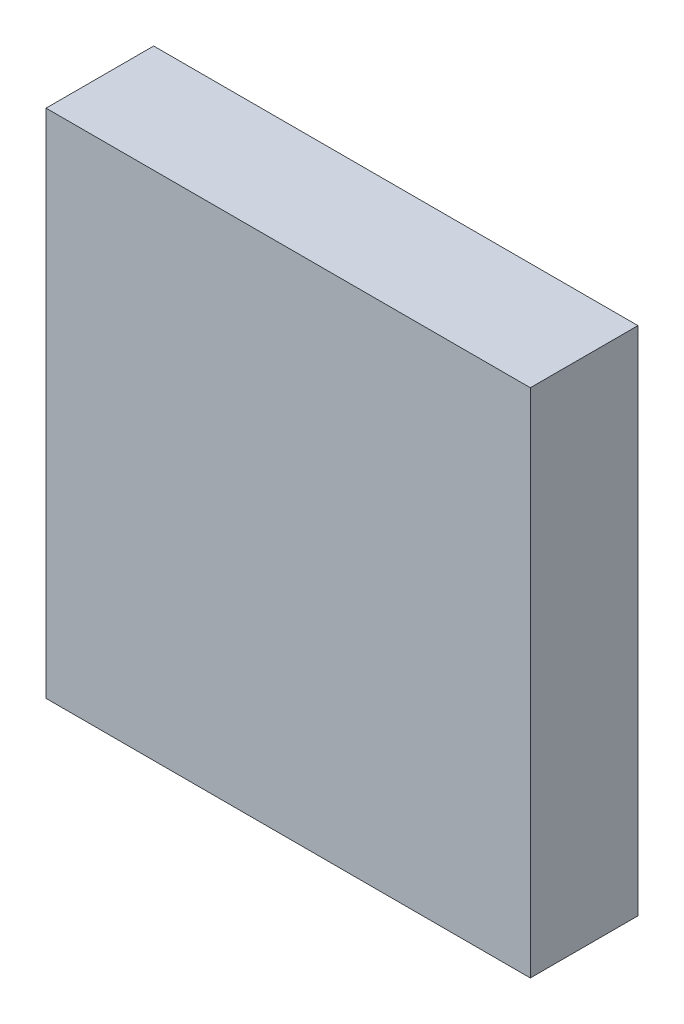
ISO-10303-21;
HEADER;
FILE_DESCRIPTION(('STEP AP214'),'2;1');
FILE_NAME('part.step','',(''),(''),'','','');
FILE_SCHEMA(('AUTOMOTIVE_DESIGN { 1 0 10303 214 1 1 1 1 }'));
ENDSEC;
DATA;
#1=APPLICATION_CONTEXT('core data for automotive mechanical design processes');
#2=APPLICATION_PROTOCOL_DEFINITION('international standard','automotive_design',2000,#1);
#3=PRODUCT_CONTEXT('',#1,'mechanical');
#4=PRODUCT('Part','Part','',(#3));
#5=PRODUCT_RELATED_PRODUCT_CATEGORY('part','',(#4));
#6=PRODUCT_DEFINITION_FORMATION('','',#4);
#7=PRODUCT_DEFINITION_CONTEXT('part definition',#1,'design');
#8=PRODUCT_DEFINITION('design','',#6,#7);
#9=PRODUCT_DEFINITION_SHAPE('','',#8);
#10=(LENGTH_UNIT() NAMED_UNIT(*) SI_UNIT(.MILLI.,.METRE.));
#11=(NAMED_UNIT(*) PLANE_ANGLE_UNIT() SI_UNIT($,.RADIAN.));
#12=(NAMED_UNIT(*) SI_UNIT($,.STERADIAN.) SOLID_ANGLE_UNIT());
#13=UNCERTAINTY_MEASURE_WITH_UNIT(LENGTH_MEASURE(1.E-05),#10,'distance_accuracy_value','');
#14=(GEOMETRIC_REPRESENTATION_CONTEXT(3) GLOBAL_UNCERTAINTY_ASSIGNED_CONTEXT((#13)) GLOBAL_UNIT_ASSIGNED_CONTEXT((#10,
#11,#12)) REPRESENTATION_CONTEXT('',''));
#15=CARTESIAN_POINT('',(0.,0.,0.));
#16=DIRECTION('',(0.,0.,1.));
#17=DIRECTION('',(1.,0.,0.));
#18=AXIS2_PLACEMENT_3D('',#15,#16,#17);
#19=CARTESIAN_POINT('',(0.,0.,20.));
#20=DIRECTION('',(1.,0.,0.));
#21=DIRECTION('',(0.,0.,-1.));
#22=AXIS2_PLACEMENT_3D('',#19,#20,#21);
#23=PLANE('',#22);
#24=DIRECTION('',(0.,-1.,0.));
#25=VECTOR('',#24,1.);
#26=CARTESIAN_POINT('',(0.,0.,0.));
#27=LINE('',#26,#25);
#28=CARTESIAN_POINT('',(0.,95.,0.));
#29=VERTEX_POINT('',#28);
#30=CARTESIAN_POINT('',(0.,0.,0.));
#31=VERTEX_POINT('',#30);
#32=EDGE_CURVE('E93',#29,#31,#27,.T.);
#33=ORIENTED_EDGE('',*,*,#32,.T.);
#34=DIRECTION('',(0.,0.,-1.));
#35=VECTOR('',#34,1.);
#36=CARTESIAN_POINT('',(0.,0.,20.));
#37=LINE('',#36,#35);
#38=CARTESIAN_POINT('',(0.,0.,20.));
#39=VERTEX_POINT('',#38);
#40=EDGE_CURVE('E11',#39,#31,#37,.T.);
#41=ORIENTED_EDGE('',*,*,#40,.F.);
#42=DIRECTION('',(0.,-1.,0.));
#43=VECTOR('',#42,1.);
#44=CARTESIAN_POINT('',(0.,0.,20.));
#45=LINE('',#44,#43);
#46=CARTESIAN_POINT('',(0.,95.,20.));
#47=VERTEX_POINT('',#46);
#48=EDGE_CURVE('E81',#47,#39,#45,.T.);
#49=ORIENTED_EDGE('',*,*,#48,.F.);
#50=DIRECTION('',(0.,0.,-1.));
#51=VECTOR('',#50,1.);
#52=CARTESIAN_POINT('',(0.,95.,20.));
#53=LINE('',#52,#51);
#54=EDGE_CURVE('E89',#47,#29,#53,.T.);
#55=ORIENTED_EDGE('',*,*,#54,.T.);
#56=EDGE_LOOP('',(#33,#41,#49,#55));
#57=FACE_BOUND('',#56,.T.);
#58=ADVANCED_FACE('F30',(#57),#23,.F.);
#59=CARTESIAN_POINT('',(0.,0.,20.));
#60=DIRECTION('',(0.,1.,0.));
#61=DIRECTION('',(0.,0.,1.));
#62=AXIS2_PLACEMENT_3D('',#59,#60,#61);
#63=PLANE('',#62);
#64=DIRECTION('',(1.,0.,0.));
#65=VECTOR('',#64,1.);
#66=CARTESIAN_POINT('',(0.,0.,0.));
#67=LINE('',#66,#65);
#68=CARTESIAN_POINT('',(90.,0.,0.));
#69=VERTEX_POINT('',#68);
#70=EDGE_CURVE('E85',#31,#69,#67,.T.);
#71=ORIENTED_EDGE('',*,*,#70,.T.);
#72=DIRECTION('',(0.,0.,-1.));
#73=VECTOR('',#72,1.);
#74=CARTESIAN_POINT('',(90.,0.,20.));
#75=LINE('',#74,#73);
#76=CARTESIAN_POINT('',(90.,0.,20.));
#77=VERTEX_POINT('',#76);
#78=EDGE_CURVE('E38',#77,#69,#75,.T.);
#79=ORIENTED_EDGE('',*,*,#78,.F.);
#80=DIRECTION('',(1.,0.,0.));
#81=VECTOR('',#80,1.);
#82=CARTESIAN_POINT('',(0.,0.,20.));
#83=LINE('',#82,#81);
#84=EDGE_CURVE('E76',#39,#77,#83,.T.);
#85=ORIENTED_EDGE('',*,*,#84,.F.);
#86=ORIENTED_EDGE('',*,*,#40,.T.);
#87=EDGE_LOOP('',(#71,#79,#85,#86));
#88=FACE_BOUND('',#87,.T.);
#89=ADVANCED_FACE('F84',(#88),#63,.F.);
#90=CARTESIAN_POINT('',(90.,0.,20.));
#91=DIRECTION('',(-1.,0.,0.));
#92=DIRECTION('',(0.,0.,1.));
#93=AXIS2_PLACEMENT_3D('',#90,#91,#92);
#94=PLANE('',#93);
#95=DIRECTION('',(0.,1.,0.));
#96=VECTOR('',#95,1.);
#97=CARTESIAN_POINT('',(90.,0.,0.));
#98=LINE('',#97,#96);
#99=CARTESIAN_POINT('',(90.,95.,0.));
#100=VERTEX_POINT('',#99);
#101=EDGE_CURVE('E63',#69,#100,#98,.T.);
#102=ORIENTED_EDGE('',*,*,#101,.T.);
#103=DIRECTION('',(0.,0.,-1.));
#104=VECTOR('',#103,1.);
#105=CARTESIAN_POINT('',(90.,95.,20.));
#106=LINE('',#105,#104);
#107=CARTESIAN_POINT('',(90.,95.,20.));
#108=VERTEX_POINT('',#107);
#109=EDGE_CURVE('E86',#108,#100,#106,.T.);
#110=ORIENTED_EDGE('',*,*,#109,.F.);
#111=DIRECTION('',(0.,1.,0.));
#112=VECTOR('',#111,1.);
#113=CARTESIAN_POINT('',(90.,0.,20.));
#114=LINE('',#113,#112);
#115=EDGE_CURVE('E79',#77,#108,#114,.T.);
#116=ORIENTED_EDGE('',*,*,#115,.F.);
#117=ORIENTED_EDGE('',*,*,#78,.T.);
#118=EDGE_LOOP('',(#102,#110,#116,#117));
#119=FACE_BOUND('',#118,.T.);
#120=ADVANCED_FACE('F87',(#119),#94,.F.);
#121=CARTESIAN_POINT('',(0.,95.,20.));
#122=DIRECTION('',(0.,-1.,0.));
#123=DIRECTION('',(0.,0.,-1.));
#124=AXIS2_PLACEMENT_3D('',#121,#122,#123);
#125=PLANE('',#124);
#126=DIRECTION('',(-1.,0.,0.));
#127=VECTOR('',#126,1.);
#128=CARTESIAN_POINT('',(0.,95.,0.));
#129=LINE('',#128,#127);
#130=EDGE_CURVE('E69',#100,#29,#129,.T.);
#131=ORIENTED_EDGE('',*,*,#130,.T.);
#132=ORIENTED_EDGE('',*,*,#54,.F.);
#133=DIRECTION('',(-1.,0.,0.));
#134=VECTOR('',#133,1.);
#135=CARTESIAN_POINT('',(0.,95.,20.));
#136=LINE('',#135,#134);
#137=EDGE_CURVE('E46',#108,#47,#136,.T.);
#138=ORIENTED_EDGE('',*,*,#137,.F.);
#139=ORIENTED_EDGE('',*,*,#109,.T.);
#140=EDGE_LOOP('',(#131,#132,#138,#139));
#141=FACE_BOUND('',#140,.T.);
#142=ADVANCED_FACE('F100',(#141),#125,.F.);
#143=CARTESIAN_POINT('',(0.,95.,20.));
#144=DIRECTION('',(0.,0.,-1.));
#145=DIRECTION('',(-1.,0.,0.));
#146=AXIS2_PLACEMENT_3D('',#143,#144,#145);
#147=PLANE('',#146);
#148=ORIENTED_EDGE('',*,*,#48,.T.);
#149=ORIENTED_EDGE('',*,*,#84,.T.);
#150=ORIENTED_EDGE('',*,*,#115,.T.);
#151=ORIENTED_EDGE('',*,*,#137,.T.);
#152=EDGE_LOOP('',(#148,#149,#150,#151));
#153=FACE_BOUND('',#152,.T.);
#154=ADVANCED_FACE('F77',(#153),#147,.F.);
#155=CARTESIAN_POINT('',(0.,95.,0.));
#156=DIRECTION('',(0.,0.,-1.));
#157=DIRECTION('',(-1.,0.,0.));
#158=AXIS2_PLACEMENT_3D('',#155,#156,#157);
#159=PLANE('',#158);
#160=ORIENTED_EDGE('',*,*,#32,.F.);
#161=ORIENTED_EDGE('',*,*,#130,.F.);
#162=ORIENTED_EDGE('',*,*,#101,.F.);
#163=ORIENTED_EDGE('',*,*,#70,.F.);
#164=EDGE_LOOP('',(#160,#161,#162,#163));
#165=FACE_BOUND('',#164,.T.);
#166=ADVANCED_FACE('F103',(#165),#159,.T.);
#167=CLOSED_SHELL('',(#58,#89,#120,#142,#154,#166));
#168=MANIFOLD_SOLID_BREP('B2',#167);
#169=ADVANCED_BREP_SHAPE_REPRESENTATION('',(#18,#168),#14);
#170=SHAPE_DEFINITION_REPRESENTATION(#9,#169);
ENDSEC;
END-ISO-10303-21;
